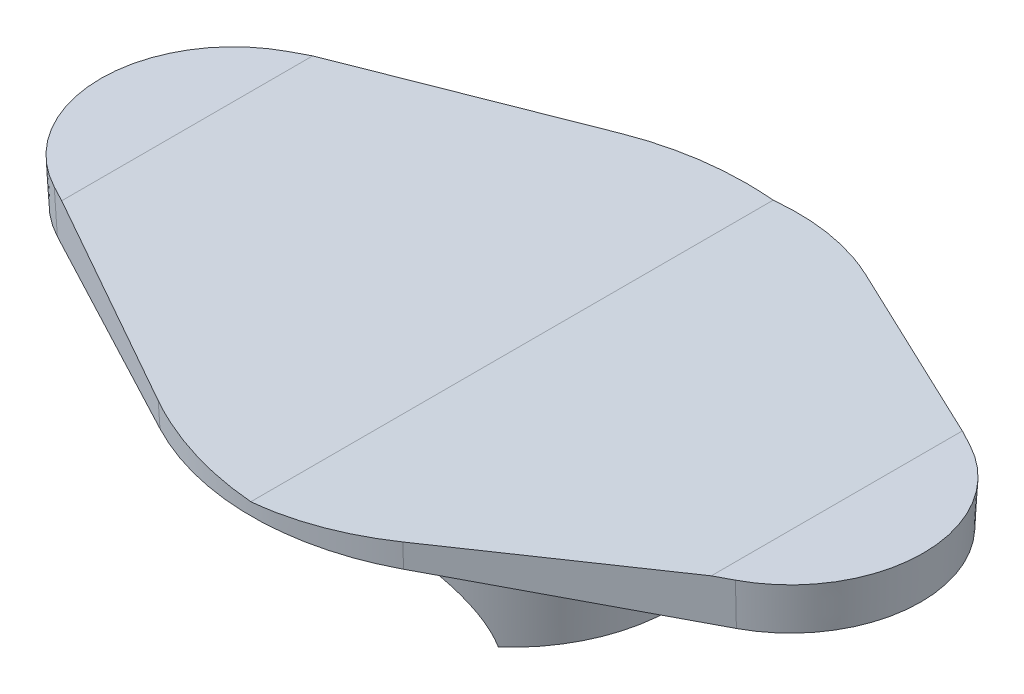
ISO-10303-21;
HEADER;
FILE_DESCRIPTION(('STEP AP214'),'2;1');
FILE_NAME('part.step','',(''),(''),'','','');
FILE_SCHEMA(('AUTOMOTIVE_DESIGN { 1 0 10303 214 1 1 1 1 }'));
ENDSEC;
DATA;
#1=APPLICATION_CONTEXT('core data for automotive mechanical design processes');
#2=APPLICATION_PROTOCOL_DEFINITION('international standard','automotive_design',2000,#1);
#3=PRODUCT_CONTEXT('',#1,'mechanical');
#4=PRODUCT('Part','Part','',(#3));
#5=PRODUCT_RELATED_PRODUCT_CATEGORY('part','',(#4));
#6=PRODUCT_DEFINITION_FORMATION('','',#4);
#7=PRODUCT_DEFINITION_CONTEXT('part definition',#1,'design');
#8=PRODUCT_DEFINITION('design','',#6,#7);
#9=PRODUCT_DEFINITION_SHAPE('','',#8);
#10=(LENGTH_UNIT() NAMED_UNIT(*) SI_UNIT(.MILLI.,.METRE.));
#11=(NAMED_UNIT(*) PLANE_ANGLE_UNIT() SI_UNIT($,.RADIAN.));
#12=(NAMED_UNIT(*) SI_UNIT($,.STERADIAN.) SOLID_ANGLE_UNIT());
#13=UNCERTAINTY_MEASURE_WITH_UNIT(LENGTH_MEASURE(1.E-05),#10,'distance_accuracy_value','');
#14=(GEOMETRIC_REPRESENTATION_CONTEXT(3) GLOBAL_UNCERTAINTY_ASSIGNED_CONTEXT((#13)) GLOBAL_UNIT_ASSIGNED_CONTEXT((#10,
#11,#12)) REPRESENTATION_CONTEXT('',''));
#15=CARTESIAN_POINT('',(0.,0.,0.));
#16=DIRECTION('',(0.,0.,1.));
#17=DIRECTION('',(1.,0.,0.));
#18=AXIS2_PLACEMENT_3D('',#15,#16,#17);
#19=CARTESIAN_POINT('',(0.,-3.81,0.));
#20=DIRECTION('',(0.,-1.,0.));
#21=DIRECTION('',(0.,0.,-1.));
#22=AXIS2_PLACEMENT_3D('',#19,#20,#21);
#23=PLANE('',#22);
#24=DIRECTION('',(0.,0.,1.));
#25=VECTOR('',#24,1.);
#26=CARTESIAN_POINT('',(3.11085197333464,-3.81,-7.69986945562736));
#27=LINE('',#26,#25);
#28=CARTESIAN_POINT('',(3.11085197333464,-3.81,-3.50956853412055));
#29=VERTEX_POINT('',#28);
#30=CARTESIAN_POINT('',(3.11085197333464,-3.81,-3.00782840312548));
#31=VERTEX_POINT('',#30);
#32=EDGE_CURVE('E186',#29,#31,#27,.T.);
#33=ORIENTED_EDGE('',*,*,#32,.F.);
#34=CARTESIAN_POINT('',(0.,-3.81,0.));
#35=DIRECTION('',(0.,-1.,0.));
#36=DIRECTION('',(0.,0.,-1.));
#37=AXIS2_PLACEMENT_3D('',#34,#35,#36);
#38=CIRCLE('',#37,4.68982636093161);
#39=CARTESIAN_POINT('',(3.11085197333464,-3.81,3.50956853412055));
#40=VERTEX_POINT('',#39);
#41=EDGE_CURVE('E297',#29,#40,#38,.T.);
#42=ORIENTED_EDGE('',*,*,#41,.T.);
#43=CARTESIAN_POINT('',(3.11085197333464,-3.81,3.00782840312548));
#44=VERTEX_POINT('',#43);
#45=EDGE_CURVE('E189',#44,#40,#27,.T.);
#46=ORIENTED_EDGE('',*,*,#45,.F.);
#47=CARTESIAN_POINT('',(0.,-3.81,0.));
#48=DIRECTION('',(0.,-1.,0.));
#49=DIRECTION('',(0.,0.,-1.));
#50=AXIS2_PLACEMENT_3D('',#47,#48,#49);
#51=CIRCLE('',#50,4.32717363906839);
#52=EDGE_CURVE('E298',#31,#44,#51,.T.);
#53=ORIENTED_EDGE('',*,*,#52,.F.);
#54=EDGE_LOOP('',(#33,#42,#46,#53));
#55=FACE_BOUND('',#54,.T.);
#56=ADVANCED_FACE('F35',(#55),#23,.T.);
#57=CARTESIAN_POINT('',(0.,0.,0.));
#58=DIRECTION('',(0.,1.,0.));
#59=DIRECTION('',(0.,0.,1.));
#60=AXIS2_PLACEMENT_3D('',#57,#58,#59);
#61=PLANE('',#60);
#62=CARTESIAN_POINT('',(0.,0.,0.));
#63=DIRECTION('',(0.,1.,0.));
#64=DIRECTION('',(0.,0.,1.));
#65=AXIS2_PLACEMENT_3D('',#62,#63,#64);
#66=CIRCLE('',#65,7.62);
#67=CARTESIAN_POINT('',(3.56159900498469,0.,-6.73642431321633));
#68=VERTEX_POINT('',#67);
#69=CARTESIAN_POINT('',(-3.56159900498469,0.,-6.73642431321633));
#70=VERTEX_POINT('',#69);
#71=EDGE_CURVE('E299',#68,#70,#66,.T.);
#72=ORIENTED_EDGE('',*,*,#71,.F.);
#73=DIRECTION('',(-0.88404518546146,0.,-0.467401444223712));
#74=VECTOR('',#73,1.);
#75=CARTESIAN_POINT('',(3.56159900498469,0.,-6.73642431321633));
#76=LINE('',#75,#74);
#77=CARTESIAN_POINT('',(9.93225056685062,0.,-3.36821215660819));
#78=VERTEX_POINT('',#77);
#79=EDGE_CURVE('E322',#78,#68,#76,.T.);
#80=ORIENTED_EDGE('',*,*,#79,.F.);
#81=CARTESIAN_POINT('',(8.15145106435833,0.,0.));
#82=DIRECTION('',(0.,1.,0.));
#83=DIRECTION('',(0.,0.,1.));
#84=AXIS2_PLACEMENT_3D('',#81,#82,#83);
#85=CIRCLE('',#84,3.81);
#86=CARTESIAN_POINT('',(9.93225056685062,0.,3.36821215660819));
#87=VERTEX_POINT('',#86);
#88=EDGE_CURVE('E319',#87,#78,#85,.T.);
#89=ORIENTED_EDGE('',*,*,#88,.F.);
#90=DIRECTION('',(0.88404518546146,0.,-0.467401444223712));
#91=VECTOR('',#90,1.);
#92=CARTESIAN_POINT('',(9.93225056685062,0.,3.36821215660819));
#93=LINE('',#92,#91);
#94=CARTESIAN_POINT('',(3.56159900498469,0.,6.73642431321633));
#95=VERTEX_POINT('',#94);
#96=EDGE_CURVE('E317',#95,#87,#93,.T.);
#97=ORIENTED_EDGE('',*,*,#96,.F.);
#98=CARTESIAN_POINT('',(0.,0.,0.));
#99=DIRECTION('',(0.,1.,0.));
#100=DIRECTION('',(0.,0.,1.));
#101=AXIS2_PLACEMENT_3D('',#98,#99,#100);
#102=CIRCLE('',#101,7.61999999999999);
#103=CARTESIAN_POINT('',(-3.56159900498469,0.,6.73642431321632));
#104=VERTEX_POINT('',#103);
#105=EDGE_CURVE('E314',#104,#95,#102,.T.);
#106=ORIENTED_EDGE('',*,*,#105,.F.);
#107=DIRECTION('',(0.88404518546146,0.,0.467401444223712));
#108=VECTOR('',#107,1.);
#109=CARTESIAN_POINT('',(-9.93225056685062,0.,3.36821215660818));
#110=LINE('',#109,#108);
#111=CARTESIAN_POINT('',(-9.93225056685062,0.,3.36821215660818));
#112=VERTEX_POINT('',#111);
#113=EDGE_CURVE('E311',#112,#104,#110,.T.);
#114=ORIENTED_EDGE('',*,*,#113,.F.);
#115=CARTESIAN_POINT('',(-8.15145106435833,0.,0.));
#116=DIRECTION('',(0.,1.,0.));
#117=DIRECTION('',(0.,0.,-1.));
#118=AXIS2_PLACEMENT_3D('',#115,#116,#117);
#119=CIRCLE('',#118,3.81);
#120=CARTESIAN_POINT('',(-9.93225056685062,0.,-3.36821215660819));
#121=VERTEX_POINT('',#120);
#122=EDGE_CURVE('E308',#121,#112,#119,.T.);
#123=ORIENTED_EDGE('',*,*,#122,.F.);
#124=DIRECTION('',(-0.88404518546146,0.,0.467401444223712));
#125=VECTOR('',#124,1.);
#126=CARTESIAN_POINT('',(-3.56159900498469,0.,-6.73642431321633));
#127=LINE('',#126,#125);
#128=EDGE_CURVE('E305',#70,#121,#127,.T.);
#129=ORIENTED_EDGE('',*,*,#128,.F.);
#130=EDGE_LOOP('',(#72,#80,#89,#97,#106,#114,#123,#129));
#131=FACE_BOUND('',#130,.T.);
#132=CARTESIAN_POINT('',(0.,0.,0.));
#133=DIRECTION('',(0.,1.,0.));
#134=DIRECTION('',(0.,0.,1.));
#135=AXIS2_PLACEMENT_3D('',#132,#133,#134);
#136=CIRCLE('',#135,4.8895);
#137=CARTESIAN_POINT('',(0.,0.,4.8895));
#138=VERTEX_POINT('',#137);
#139=EDGE_CURVE('E328',#138,#138,#136,.F.);
#140=ORIENTED_EDGE('',*,*,#139,.F.);
#141=EDGE_LOOP('',(#140));
#142=FACE_BOUND('',#141,.T.);
#143=ADVANCED_FACE('F242',(#131,#142),#61,.F.);
#144=CARTESIAN_POINT('',(0.,0.,0.));
#145=DIRECTION('',(0.,1.,0.));
#146=DIRECTION('',(0.,0.,1.));
#147=AXIS2_PLACEMENT_3D('',#144,#145,#146);
#148=CONICAL_SURFACE('',#147,7.62,0.05235987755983);
#149=DIRECTION('',(-0.024461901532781,0.998629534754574,-0.0462673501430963));
#150=VECTOR('',#149,1.);
#151=CARTESIAN_POINT('',(-3.56159900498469,0.,-6.73642431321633));
#152=LINE('',#151,#150);
#153=CARTESIAN_POINT('',(-3.57913494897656,0.71588513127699,-6.76959187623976));
#154=VERTEX_POINT('',#153);
#155=EDGE_CURVE('E326',#154,#70,#152,.F.);
#156=ORIENTED_EDGE('',*,*,#155,.F.);
#157=CARTESIAN_POINT('',(-0.0374641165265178,0.384505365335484,0.));
#158=DIRECTION('',(-0.0931590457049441,-0.995651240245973,0.));
#159=DIRECTION('',(-0.995651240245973,0.0931590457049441,0.));
#160=AXIS2_PLACEMENT_3D('',#157,#158,#159);
#161=ELLIPSE('',#160,7.67352137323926,7.64005921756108);
#162=CARTESIAN_POINT('',(0.,0.381,-7.63996736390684));
#163=VERTEX_POINT('',#162);
#164=EDGE_CURVE('E175',#154,#163,#161,.T.);
#165=ORIENTED_EDGE('',*,*,#164,.T.);
#166=CARTESIAN_POINT('',(0.0374641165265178,0.384505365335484,0.));
#167=DIRECTION('',(0.0931590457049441,-0.995651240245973,0.));
#168=DIRECTION('',(0.995651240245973,0.0931590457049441,0.));
#169=AXIS2_PLACEMENT_3D('',#166,#167,#168);
#170=ELLIPSE('',#169,7.67352137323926,7.64005921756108);
#171=CARTESIAN_POINT('',(3.57913494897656,0.715885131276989,-6.76959187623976));
#172=VERTEX_POINT('',#171);
#173=EDGE_CURVE('E148',#163,#172,#170,.T.);
#174=ORIENTED_EDGE('',*,*,#173,.T.);
#175=DIRECTION('',(0.024461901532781,0.998629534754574,-0.0462673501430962));
#176=VECTOR('',#175,1.);
#177=CARTESIAN_POINT('',(3.56159900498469,0.,-6.73642431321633));
#178=LINE('',#177,#176);
#179=EDGE_CURVE('E325',#172,#68,#178,.F.);
#180=ORIENTED_EDGE('',*,*,#179,.T.);
#181=ORIENTED_EDGE('',*,*,#71,.T.);
#182=EDGE_LOOP('',(#156,#165,#174,#180,#181));
#183=FACE_BOUND('',#182,.T.);
#184=ADVANCED_FACE('F243',(#183),#148,.T.);
#185=CARTESIAN_POINT('',(-3.56159900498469,0.,-6.73642431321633));
#186=DIRECTION('',(-0.466760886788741,-0.0523359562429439,-0.882833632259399));
#187=DIRECTION('',(-0.88404518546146,0.,0.467401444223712));
#188=AXIS2_PLACEMENT_3D('',#185,#186,#187);
#189=PLANE('',#188);
#190=DIRECTION('',(-0.88404518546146,0.,0.467401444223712));
#191=VECTOR('',#190,1.);
#192=CARTESIAN_POINT('',(-3.59270825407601,1.27,-6.79526448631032));
#193=LINE('',#192,#191);
#194=CARTESIAN_POINT('',(-9.96335981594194,1.27,-3.42705232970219));
#195=VERTEX_POINT('',#194);
#196=CARTESIAN_POINT('',(-9.50132051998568,1.27,-3.67133603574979));
#197=VERTEX_POINT('',#196);
#198=EDGE_CURVE('E181',#195,#197,#193,.F.);
#199=ORIENTED_EDGE('',*,*,#198,.T.);
#200=DIRECTION('',(-0.883038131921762,0.0826222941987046,0.461971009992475));
#201=VECTOR('',#200,1.);
#202=CARTESIAN_POINT('',(-3.5267614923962,0.71098475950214,-6.79699162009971));
#203=LINE('',#202,#201);
#204=EDGE_CURVE('E168',#197,#154,#203,.F.);
#205=ORIENTED_EDGE('',*,*,#204,.T.);
#206=ORIENTED_EDGE('',*,*,#155,.T.);
#207=ORIENTED_EDGE('',*,*,#128,.T.);
#208=DIRECTION('',(-0.0244619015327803,0.998629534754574,-0.0462673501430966));
#209=VECTOR('',#208,1.);
#210=CARTESIAN_POINT('',(-9.93225056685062,0.,-3.36821215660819));
#211=LINE('',#210,#209);
#212=EDGE_CURVE('E329',#195,#121,#211,.F.);
#213=ORIENTED_EDGE('',*,*,#212,.F.);
#214=EDGE_LOOP('',(#199,#205,#206,#207,#213));
#215=FACE_BOUND('',#214,.T.);
#216=ADVANCED_FACE('F246',(#215),#189,.T.);
#217=CARTESIAN_POINT('',(-8.15145106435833,0.,0.));
#218=DIRECTION('',(0.,1.,0.));
#219=DIRECTION('',(0.,0.,-1.));
#220=AXIS2_PLACEMENT_3D('',#217,#218,#219);
#221=CONICAL_SURFACE('',#220,3.81,0.05235987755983);
#222=DIRECTION('',(-0.024461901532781,0.998629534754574,0.0462673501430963));
#223=VECTOR('',#222,1.);
#224=CARTESIAN_POINT('',(-9.93225056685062,0.,3.36821215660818));
#225=LINE('',#224,#223);
#226=CARTESIAN_POINT('',(-9.96335981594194,1.27,3.42705232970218));
#227=VERTEX_POINT('',#226);
#228=EDGE_CURVE('E338',#227,#112,#225,.F.);
#229=ORIENTED_EDGE('',*,*,#228,.F.);
#230=CARTESIAN_POINT('',(-8.15145106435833,1.27,0.));
#231=DIRECTION('',(0.,-1.,0.));
#232=DIRECTION('',(0.,0.,-1.));
#233=AXIS2_PLACEMENT_3D('',#230,#231,#232);
#234=CIRCLE('',#233,3.87655787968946);
#235=EDGE_CURVE('E178',#227,#195,#234,.T.);
#236=ORIENTED_EDGE('',*,*,#235,.T.);
#237=ORIENTED_EDGE('',*,*,#212,.T.);
#238=ORIENTED_EDGE('',*,*,#122,.T.);
#239=EDGE_LOOP('',(#229,#236,#237,#238));
#240=FACE_BOUND('',#239,.T.);
#241=ADVANCED_FACE('F265',(#240),#221,.T.);
#242=CARTESIAN_POINT('',(-9.93225056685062,0.,3.36821215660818));
#243=DIRECTION('',(-0.466760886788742,-0.0523359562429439,0.882833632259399));
#244=DIRECTION('',(0.88404518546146,0.,0.467401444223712));
#245=AXIS2_PLACEMENT_3D('',#242,#243,#244);
#246=PLANE('',#245);
#247=DIRECTION('',(-0.0244619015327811,0.998629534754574,0.0462673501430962));
#248=VECTOR('',#247,1.);
#249=CARTESIAN_POINT('',(-3.56159900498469,0.,6.73642431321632));
#250=LINE('',#249,#248);
#251=CARTESIAN_POINT('',(-3.57913494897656,0.71588513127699,6.76959187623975));
#252=VERTEX_POINT('',#251);
#253=EDGE_CURVE('E336',#252,#104,#250,.F.);
#254=ORIENTED_EDGE('',*,*,#253,.F.);
#255=DIRECTION('',(0.883038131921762,-0.0826222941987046,0.461971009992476));
#256=VECTOR('',#255,1.);
#257=CARTESIAN_POINT('',(-9.86833924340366,1.30434045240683,3.4793261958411));
#258=LINE('',#257,#256);
#259=CARTESIAN_POINT('',(-9.50132051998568,1.27,3.67133603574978));
#260=VERTEX_POINT('',#259);
#261=EDGE_CURVE('E164',#252,#260,#258,.F.);
#262=ORIENTED_EDGE('',*,*,#261,.T.);
#263=DIRECTION('',(0.88404518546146,0.,0.467401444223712));
#264=VECTOR('',#263,1.);
#265=CARTESIAN_POINT('',(-9.96335981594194,1.27,3.42705232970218));
#266=LINE('',#265,#264);
#267=EDGE_CURVE('E482',#260,#227,#266,.F.);
#268=ORIENTED_EDGE('',*,*,#267,.T.);
#269=ORIENTED_EDGE('',*,*,#228,.T.);
#270=ORIENTED_EDGE('',*,*,#113,.T.);
#271=EDGE_LOOP('',(#254,#262,#268,#269,#270));
#272=FACE_BOUND('',#271,.T.);
#273=ADVANCED_FACE('F261',(#272),#246,.T.);
#274=CARTESIAN_POINT('',(0.,0.,0.));
#275=DIRECTION('',(0.,1.,0.));
#276=DIRECTION('',(0.,0.,1.));
#277=AXIS2_PLACEMENT_3D('',#274,#275,#276);
#278=CONICAL_SURFACE('',#277,7.61999999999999,0.05235987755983);
#279=CARTESIAN_POINT('',(0.0374641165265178,0.384505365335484,0.));
#280=DIRECTION('',(0.0931590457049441,-0.995651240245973,0.));
#281=DIRECTION('',(0.995651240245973,0.0931590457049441,0.));
#282=AXIS2_PLACEMENT_3D('',#279,#280,#281);
#283=ELLIPSE('',#282,7.67352137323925,7.64005921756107);
#284=CARTESIAN_POINT('',(3.57913494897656,0.715885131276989,6.76959187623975));
#285=VERTEX_POINT('',#284);
#286=CARTESIAN_POINT('',(0.,0.381,7.63996736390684));
#287=VERTEX_POINT('',#286);
#288=EDGE_CURVE('E144',#285,#287,#283,.T.);
#289=ORIENTED_EDGE('',*,*,#288,.T.);
#290=CARTESIAN_POINT('',(-0.0374641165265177,0.384505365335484,0.));
#291=DIRECTION('',(-0.0931590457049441,-0.995651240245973,0.));
#292=DIRECTION('',(-0.995651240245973,0.0931590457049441,0.));
#293=AXIS2_PLACEMENT_3D('',#290,#291,#292);
#294=ELLIPSE('',#293,7.67352137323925,7.64005921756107);
#295=EDGE_CURVE('E484',#287,#252,#294,.T.);
#296=ORIENTED_EDGE('',*,*,#295,.T.);
#297=ORIENTED_EDGE('',*,*,#253,.T.);
#298=ORIENTED_EDGE('',*,*,#105,.T.);
#299=DIRECTION('',(0.024461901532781,0.998629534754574,0.0462673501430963));
#300=VECTOR('',#299,1.);
#301=CARTESIAN_POINT('',(3.56159900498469,0.,6.73642431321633));
#302=LINE('',#301,#300);
#303=EDGE_CURVE('E334',#285,#95,#302,.F.);
#304=ORIENTED_EDGE('',*,*,#303,.F.);
#305=EDGE_LOOP('',(#289,#296,#297,#298,#304));
#306=FACE_BOUND('',#305,.T.);
#307=ADVANCED_FACE('F258',(#306),#278,.T.);
#308=CARTESIAN_POINT('',(9.93225056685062,0.,3.36821215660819));
#309=DIRECTION('',(0.466760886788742,-0.0523359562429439,0.882833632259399));
#310=DIRECTION('',(0.88404518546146,0.,-0.467401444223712));
#311=AXIS2_PLACEMENT_3D('',#308,#309,#310);
#312=PLANE('',#311);
#313=DIRECTION('',(0.0244619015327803,0.998629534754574,0.0462673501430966));
#314=VECTOR('',#313,1.);
#315=CARTESIAN_POINT('',(9.93225056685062,0.,3.36821215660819));
#316=LINE('',#315,#314);
#317=CARTESIAN_POINT('',(9.96335981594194,1.27,3.42705232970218));
#318=VERTEX_POINT('',#317);
#319=EDGE_CURVE('E163',#318,#87,#316,.F.);
#320=ORIENTED_EDGE('',*,*,#319,.F.);
#321=DIRECTION('',(0.88404518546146,0.,-0.467401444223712));
#322=VECTOR('',#321,1.);
#323=CARTESIAN_POINT('',(9.96335981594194,1.27,3.42705232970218));
#324=LINE('',#323,#322);
#325=CARTESIAN_POINT('',(9.50132051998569,1.27,3.67133603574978));
#326=VERTEX_POINT('',#325);
#327=EDGE_CURVE('E152',#318,#326,#324,.F.);
#328=ORIENTED_EDGE('',*,*,#327,.T.);
#329=DIRECTION('',(0.883038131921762,0.0826222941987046,-0.461971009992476));
#330=VECTOR('',#329,1.);
#331=CARTESIAN_POINT('',(9.86833924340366,1.30434045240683,3.47932619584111));
#332=LINE('',#331,#330);
#333=EDGE_CURVE('E140',#326,#285,#332,.F.);
#334=ORIENTED_EDGE('',*,*,#333,.T.);
#335=ORIENTED_EDGE('',*,*,#303,.T.);
#336=ORIENTED_EDGE('',*,*,#96,.T.);
#337=EDGE_LOOP('',(#320,#328,#334,#335,#336));
#338=FACE_BOUND('',#337,.T.);
#339=ADVANCED_FACE('F161',(#338),#312,.T.);
#340=CARTESIAN_POINT('',(8.15145106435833,0.,0.));
#341=DIRECTION('',(0.,1.,0.));
#342=DIRECTION('',(0.,0.,1.));
#343=AXIS2_PLACEMENT_3D('',#340,#341,#342);
#344=CONICAL_SURFACE('',#343,3.81,0.05235987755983);
#345=DIRECTION('',(0.024461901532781,0.998629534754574,-0.0462673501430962));
#346=VECTOR('',#345,1.);
#347=CARTESIAN_POINT('',(9.93225056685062,0.,-3.36821215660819));
#348=LINE('',#347,#346);
#349=CARTESIAN_POINT('',(9.96335981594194,1.27,-3.42705232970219));
#350=VERTEX_POINT('',#349);
#351=EDGE_CURVE('E331',#350,#78,#348,.F.);
#352=ORIENTED_EDGE('',*,*,#351,.F.);
#353=CARTESIAN_POINT('',(8.15145106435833,1.27,0.));
#354=DIRECTION('',(0.,-1.,0.));
#355=DIRECTION('',(0.,0.,-1.));
#356=AXIS2_PLACEMENT_3D('',#353,#354,#355);
#357=CIRCLE('',#356,3.87655787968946);
#358=EDGE_CURVE('E165',#350,#318,#357,.T.);
#359=ORIENTED_EDGE('',*,*,#358,.T.);
#360=ORIENTED_EDGE('',*,*,#319,.T.);
#361=ORIENTED_EDGE('',*,*,#88,.T.);
#362=EDGE_LOOP('',(#352,#359,#360,#361));
#363=FACE_BOUND('',#362,.T.);
#364=ADVANCED_FACE('F251',(#363),#344,.T.);
#365=CARTESIAN_POINT('',(3.56159900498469,0.,-6.73642431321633));
#366=DIRECTION('',(0.466760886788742,-0.0523359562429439,-0.882833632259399));
#367=DIRECTION('',(-0.88404518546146,0.,-0.467401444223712));
#368=AXIS2_PLACEMENT_3D('',#365,#366,#367);
#369=PLANE('',#368);
#370=DIRECTION('',(-0.883038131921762,-0.0826222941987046,-0.461971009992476));
#371=VECTOR('',#370,1.);
#372=CARTESIAN_POINT('',(3.5267614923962,0.71098475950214,-6.79699162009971));
#373=LINE('',#372,#371);
#374=CARTESIAN_POINT('',(9.50132051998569,1.27,-3.67133603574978));
#375=VERTEX_POINT('',#374);
#376=EDGE_CURVE('E230',#172,#375,#373,.F.);
#377=ORIENTED_EDGE('',*,*,#376,.T.);
#378=DIRECTION('',(-0.88404518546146,0.,-0.467401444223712));
#379=VECTOR('',#378,1.);
#380=CARTESIAN_POINT('',(3.59270825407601,1.27,-6.79526448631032));
#381=LINE('',#380,#379);
#382=EDGE_CURVE('E155',#375,#350,#381,.F.);
#383=ORIENTED_EDGE('',*,*,#382,.T.);
#384=ORIENTED_EDGE('',*,*,#351,.T.);
#385=ORIENTED_EDGE('',*,*,#79,.T.);
#386=ORIENTED_EDGE('',*,*,#179,.F.);
#387=EDGE_LOOP('',(#377,#383,#384,#385,#386));
#388=FACE_BOUND('',#387,.T.);
#389=ADVANCED_FACE('F248',(#388),#369,.T.);
#390=DIRECTION('',(0.,0.,1.));
#391=VECTOR('',#390,1.);
#392=CARTESIAN_POINT('',(-3.11085197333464,-3.81,-7.69986945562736));
#393=LINE('',#392,#391);
#394=CARTESIAN_POINT('',(-3.11085197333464,-3.81,3.50956853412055));
#395=VERTEX_POINT('',#394);
#396=CARTESIAN_POINT('',(-3.11085197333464,-3.81,3.00782840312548));
#397=VERTEX_POINT('',#396);
#398=EDGE_CURVE('E58',#395,#397,#393,.F.);
#399=ORIENTED_EDGE('',*,*,#398,.F.);
#400=CARTESIAN_POINT('',(-3.11085197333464,-3.81,-3.50956853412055));
#401=VERTEX_POINT('',#400);
#402=EDGE_CURVE('E290',#395,#401,#38,.T.);
#403=ORIENTED_EDGE('',*,*,#402,.T.);
#404=CARTESIAN_POINT('',(-3.11085197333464,-3.81,-3.00782840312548));
#405=VERTEX_POINT('',#404);
#406=EDGE_CURVE('E184',#405,#401,#393,.F.);
#407=ORIENTED_EDGE('',*,*,#406,.F.);
#408=EDGE_CURVE('E292',#397,#405,#51,.T.);
#409=ORIENTED_EDGE('',*,*,#408,.F.);
#410=EDGE_LOOP('',(#399,#403,#407,#409));
#411=FACE_BOUND('',#410,.T.);
#412=ADVANCED_FACE('F214',(#411),#23,.T.);
#413=CARTESIAN_POINT('',(0.,0.,0.));
#414=DIRECTION('',(0.,1.,0.));
#415=DIRECTION('',(0.,0.,-1.));
#416=AXIS2_PLACEMENT_3D('',#413,#414,#415);
#417=CONICAL_SURFACE('',#416,4.8895,0.05235987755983);
#418=ORIENTED_EDGE('',*,*,#402,.F.);
#419=CARTESIAN_POINT('',(-3.11089279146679,-3.81020000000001,3.5095183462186));
#420=CARTESIAN_POINT('',(-3.09244623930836,-3.71981178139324,3.53219478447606));
#421=CARTESIAN_POINT('',(-3.07022673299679,-3.63101749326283,3.55776072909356));
#422=CARTESIAN_POINT('',(-3.01876055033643,-3.45711295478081,3.61341733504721));
#423=CARTESIAN_POINT('',(-2.98952552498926,-3.37199686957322,3.64350046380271));
#424=CARTESIAN_POINT('',(-2.92463203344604,-3.20602550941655,3.70687441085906));
#425=CARTESIAN_POINT('',(-2.88900361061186,-3.12515249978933,3.74014990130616));
#426=CARTESIAN_POINT('',(-2.811591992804,-2.96740049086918,3.80896841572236));
#427=CARTESIAN_POINT('',(-2.76980596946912,-2.89052334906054,3.84451247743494));
#428=CARTESIAN_POINT('',(-2.63621087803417,-2.66707826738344,3.95262261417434));
#429=CARTESIAN_POINT('',(-2.53570045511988,-2.52652767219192,4.02713949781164));
#430=CARTESIAN_POINT('',(-2.31274635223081,-2.26285481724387,4.17501454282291));
#431=CARTESIAN_POINT('',(-2.19024911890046,-2.13977645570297,4.2483693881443));
#432=CARTESIAN_POINT('',(-1.9084978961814,-1.90015469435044,4.39647481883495));
#433=CARTESIAN_POINT('',(-1.74661307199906,-1.78609249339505,4.47037034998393));
#434=CARTESIAN_POINT('',(-1.48659605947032,-1.63775628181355,4.56879427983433));
#435=CARTESIAN_POINT('',(-1.3971162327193,-1.59212381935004,4.59951798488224));
#436=CARTESIAN_POINT('',(-1.21293982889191,-1.50908465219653,4.65597506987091));
#437=CARTESIAN_POINT('',(-1.11824568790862,-1.47167414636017,4.68171075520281));
#438=CARTESIAN_POINT('',(-0.882410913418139,-1.39156822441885,4.73719326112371));
#439=CARTESIAN_POINT('',(-0.738886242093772,-1.35357803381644,4.76386554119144));
#440=CARTESIAN_POINT('',(-0.44613625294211,-1.29797490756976,4.80305947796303));
#441=CARTESIAN_POINT('',(-0.296914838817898,-1.28034826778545,4.81559065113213));
#442=CARTESIAN_POINT('',(0.00332292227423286,-1.26644246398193,4.82546847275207));
#443=CARTESIAN_POINT('',(0.154342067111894,-1.27020264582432,4.82278713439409));
#444=CARTESIAN_POINT('',(0.453316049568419,-1.29893889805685,4.80240759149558));
#445=CARTESIAN_POINT('',(0.601270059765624,-1.32392062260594,4.7847053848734));
#446=CARTESIAN_POINT('',(0.886852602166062,-1.39291158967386,4.73631790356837));
#447=CARTESIAN_POINT('',(1.02463617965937,-1.4364927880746,4.70592501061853));
#448=CARTESIAN_POINT('',(1.29058115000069,-1.54061716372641,4.6343876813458));
#449=CARTESIAN_POINT('',(1.41874144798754,-1.60116226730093,4.59324202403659));
#450=CARTESIAN_POINT('',(1.67742492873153,-1.74478664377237,4.49763192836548));
#451=CARTESIAN_POINT('',(1.80660096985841,-1.82963167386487,4.44219127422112));
#452=CARTESIAN_POINT('',(2.04962821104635,-2.01537113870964,4.32466953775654));
#453=CARTESIAN_POINT('',(2.16345723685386,-2.11628834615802,4.26257907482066));
#454=CARTESIAN_POINT('',(2.39417056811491,-2.3520267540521,4.1238516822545));
#455=CARTESIAN_POINT('',(2.50782023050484,-2.48967418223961,4.04662823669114));
#456=CARTESIAN_POINT('',(2.71092910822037,-2.782708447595,3.89476328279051));
#457=CARTESIAN_POINT('',(2.8004332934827,-2.93806152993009,3.82011720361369));
#458=CARTESIAN_POINT('',(2.92856267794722,-3.21249714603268,3.70372220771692));
#459=CARTESIAN_POINT('',(2.97428150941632,-3.32706517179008,3.65914053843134));
#460=CARTESIAN_POINT('',(3.05269338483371,-3.56341649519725,3.57771889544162));
#461=CARTESIAN_POINT('',(3.08536159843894,-3.68521304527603,3.54089374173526));
#462=CARTESIAN_POINT('',(3.11089279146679,-3.81020000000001,3.5095183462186));
#463=B_SPLINE_CURVE_WITH_KNOTS('',3,(#419,#420,#421,#422,#423,#424,#425,#426,#427,#428,#429,
#430,#431,#432,#433,#434,#435,#436,#437,#438,#439,#440,#441,#442,#443,#444,#445,#446,#447,#448,
#449,#450,#451,#452,#453,#454,#455,#456,#457,#458,#459,#460,#461,#462),.UNSPECIFIED.,.F.,.F.,(4,
2,2,2,2,2,2,2,2,2,2,2,2,2,2,2,2,2,2,2,2,4),(0.,0.284724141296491,0.56897866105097,
0.851930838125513,1.13501339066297,1.6971905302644,2.2607560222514,2.8907640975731,
3.20539951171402,3.51988915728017,3.9703151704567,4.42043788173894,4.87138896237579,
5.32246022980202,5.76366738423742,6.20492465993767,6.69567207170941,7.18712111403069,
7.76827254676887,8.34833401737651,8.74083610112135,9.13408144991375),.UNSPECIFIED.);
#464=EDGE_CURVE('E197',#395,#40,#463,.T.);
#465=ORIENTED_EDGE('',*,*,#464,.T.);
#466=ORIENTED_EDGE('',*,*,#41,.F.);
#467=CARTESIAN_POINT('',(3.11089279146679,-3.81020000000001,-3.5095183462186));
#468=CARTESIAN_POINT('',(3.09244623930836,-3.71981178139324,-3.53219478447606));
#469=CARTESIAN_POINT('',(3.07022673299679,-3.63101749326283,-3.55776072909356));
#470=CARTESIAN_POINT('',(3.01876055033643,-3.45711295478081,-3.61341733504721));
#471=CARTESIAN_POINT('',(2.98952552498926,-3.37199686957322,-3.64350046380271));
#472=CARTESIAN_POINT('',(2.92463203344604,-3.20602550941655,-3.70687441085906));
#473=CARTESIAN_POINT('',(2.88900361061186,-3.12515249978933,-3.74014990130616));
#474=CARTESIAN_POINT('',(2.811591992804,-2.96740049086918,-3.80896841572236));
#475=CARTESIAN_POINT('',(2.76980596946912,-2.89052334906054,-3.84451247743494));
#476=CARTESIAN_POINT('',(2.63621087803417,-2.66707826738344,-3.95262261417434));
#477=CARTESIAN_POINT('',(2.53570045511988,-2.52652767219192,-4.02713949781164));
#478=CARTESIAN_POINT('',(2.31274635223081,-2.26285481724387,-4.17501454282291));
#479=CARTESIAN_POINT('',(2.19024911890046,-2.13977645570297,-4.2483693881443));
#480=CARTESIAN_POINT('',(1.9084978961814,-1.90015469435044,-4.39647481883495));
#481=CARTESIAN_POINT('',(1.74661307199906,-1.78609249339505,-4.47037034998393));
#482=CARTESIAN_POINT('',(1.48659605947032,-1.63775628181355,-4.56879427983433));
#483=CARTESIAN_POINT('',(1.3971162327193,-1.59212381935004,-4.59951798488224));
#484=CARTESIAN_POINT('',(1.21293982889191,-1.50908465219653,-4.65597506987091));
#485=CARTESIAN_POINT('',(1.11824568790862,-1.47167414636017,-4.68171075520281));
#486=CARTESIAN_POINT('',(0.882410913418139,-1.39156822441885,-4.73719326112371));
#487=CARTESIAN_POINT('',(0.738886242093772,-1.35357803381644,-4.76386554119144));
#488=CARTESIAN_POINT('',(0.44613625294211,-1.29797490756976,-4.80305947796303));
#489=CARTESIAN_POINT('',(0.296914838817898,-1.28034826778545,-4.81559065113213));
#490=CARTESIAN_POINT('',(-0.00332292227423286,-1.26644246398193,-4.82546847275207));
#491=CARTESIAN_POINT('',(-0.154342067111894,-1.27020264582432,-4.82278713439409));
#492=CARTESIAN_POINT('',(-0.453316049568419,-1.29893889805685,-4.80240759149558));
#493=CARTESIAN_POINT('',(-0.601270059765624,-1.32392062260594,-4.7847053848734));
#494=CARTESIAN_POINT('',(-0.886852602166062,-1.39291158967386,-4.73631790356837));
#495=CARTESIAN_POINT('',(-1.02463617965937,-1.4364927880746,-4.70592501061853));
#496=CARTESIAN_POINT('',(-1.29058115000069,-1.54061716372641,-4.6343876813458));
#497=CARTESIAN_POINT('',(-1.41874144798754,-1.60116226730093,-4.59324202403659));
#498=CARTESIAN_POINT('',(-1.67742492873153,-1.74478664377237,-4.49763192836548));
#499=CARTESIAN_POINT('',(-1.80660096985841,-1.82963167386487,-4.44219127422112));
#500=CARTESIAN_POINT('',(-2.04962821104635,-2.01537113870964,-4.32466953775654));
#501=CARTESIAN_POINT('',(-2.16345723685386,-2.11628834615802,-4.26257907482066));
#502=CARTESIAN_POINT('',(-2.39417056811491,-2.3520267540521,-4.1238516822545));
#503=CARTESIAN_POINT('',(-2.50782023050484,-2.48967418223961,-4.04662823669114));
#504=CARTESIAN_POINT('',(-2.71092910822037,-2.782708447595,-3.89476328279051));
#505=CARTESIAN_POINT('',(-2.8004332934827,-2.93806152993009,-3.82011720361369));
#506=CARTESIAN_POINT('',(-2.92856267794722,-3.21249714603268,-3.70372220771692));
#507=CARTESIAN_POINT('',(-2.97428150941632,-3.32706517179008,-3.65914053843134));
#508=CARTESIAN_POINT('',(-3.05269338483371,-3.56341649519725,-3.57771889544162));
#509=CARTESIAN_POINT('',(-3.08536159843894,-3.68521304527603,-3.54089374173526));
#510=CARTESIAN_POINT('',(-3.11089279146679,-3.81020000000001,-3.5095183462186));
#511=B_SPLINE_CURVE_WITH_KNOTS('',3,(#467,#468,#469,#470,#471,#472,#473,#474,#475,#476,#477,
#478,#479,#480,#481,#482,#483,#484,#485,#486,#487,#488,#489,#490,#491,#492,#493,#494,#495,#496,
#497,#498,#499,#500,#501,#502,#503,#504,#505,#506,#507,#508,#509,#510),.UNSPECIFIED.,.F.,.F.,(4,
2,2,2,2,2,2,2,2,2,2,2,2,2,2,2,2,2,2,2,2,4),(0.,0.284724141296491,0.56897866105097,
0.851930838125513,1.13501339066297,1.6971905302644,2.2607560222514,2.8907640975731,
3.20539951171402,3.51988915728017,3.9703151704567,4.42043788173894,4.87138896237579,
5.32246022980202,5.76366738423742,6.20492465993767,6.69567207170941,7.18712111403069,
7.76827254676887,8.34833401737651,8.74083610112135,9.13408144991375),.UNSPECIFIED.);
#512=EDGE_CURVE('E188',#29,#401,#511,.T.);
#513=ORIENTED_EDGE('',*,*,#512,.T.);
#514=EDGE_LOOP('',(#418,#465,#466,#513));
#515=FACE_BOUND('',#514,.T.);
#516=ORIENTED_EDGE('',*,*,#139,.T.);
#517=EDGE_LOOP('',(#516));
#518=FACE_BOUND('',#517,.T.);
#519=ADVANCED_FACE('F202',(#515,#518),#417,.T.);
#520=CARTESIAN_POINT('',(0.,0.,0.));
#521=DIRECTION('',(0.,-1.,0.));
#522=DIRECTION('',(0.,0.,-1.));
#523=AXIS2_PLACEMENT_3D('',#520,#521,#522);
#524=CONICAL_SURFACE('',#523,4.1275,0.05235987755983);
#525=CARTESIAN_POINT('',(0.,-0.481413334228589,0.));
#526=DIRECTION('',(0.,1.,0.));
#527=DIRECTION('',(0.,0.,1.));
#528=AXIS2_PLACEMENT_3D('',#525,#526,#527);
#529=CIRCLE('',#528,4.15272980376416);
#530=CARTESIAN_POINT('',(0.,-0.481413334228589,4.15272980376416));
#531=VERTEX_POINT('',#530);
#532=EDGE_CURVE('E11',#531,#531,#529,.T.);
#533=ORIENTED_EDGE('',*,*,#532,.T.);
#534=EDGE_LOOP('',(#533));
#535=FACE_BOUND('',#534,.T.);
#536=CARTESIAN_POINT('',(-3.11089279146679,-3.81020000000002,3.00780126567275));
#537=CARTESIAN_POINT('',(-3.07645269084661,-3.64159117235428,3.03066157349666));
#538=CARTESIAN_POINT('',(-3.02901578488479,-3.47883568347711,3.06676704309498));
#539=CARTESIAN_POINT('',(-2.91168524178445,-3.16827037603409,3.156244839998));
#540=CARTESIAN_POINT('',(-2.84199468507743,-3.02034071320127,3.20946104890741));
#541=CARTESIAN_POINT('',(-2.68363693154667,-2.74077833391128,3.32417525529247));
#542=CARTESIAN_POINT('',(-2.59513275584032,-2.60902005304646,3.38560052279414));
#543=CARTESIAN_POINT('',(-2.39992973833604,-2.36028473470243,3.51091331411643));
#544=CARTESIAN_POINT('',(-2.2931680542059,-2.24336126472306,3.57480873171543));
#545=CARTESIAN_POINT('',(-2.03991250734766,-2.00467351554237,3.71183966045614));
#546=CARTESIAN_POINT('',(-1.88972913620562,-1.88638130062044,3.78435889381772));
#547=CARTESIAN_POINT('',(-1.6478322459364,-1.72939639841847,3.88393210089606));
#548=CARTESIAN_POINT('',(-1.56447130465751,-1.68049458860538,3.91557660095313));
#549=CARTESIAN_POINT('',(-1.39255100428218,-1.59002865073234,3.97493989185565));
#550=CARTESIAN_POINT('',(-1.30399355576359,-1.5484618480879,4.00266011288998));
#551=CARTESIAN_POINT('',(-1.07532471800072,-1.45393397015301,4.06634124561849));
#552=CARTESIAN_POINT('',(-0.932141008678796,-1.40612172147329,4.09919898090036));
#553=CARTESIAN_POINT('',(-0.638136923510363,-1.33109620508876,4.15114737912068));
#554=CARTESIAN_POINT('',(-0.487322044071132,-1.30386833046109,4.1702478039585));
#555=CARTESIAN_POINT('',(-0.181646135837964,-1.27146764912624,4.19300746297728));
#556=CARTESIAN_POINT('',(-0.0267736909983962,-1.26636578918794,4.19661702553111));
#557=CARTESIAN_POINT('',(0.281617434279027,-1.27875007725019,4.18789480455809));
#558=CARTESIAN_POINT('',(0.435135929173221,-1.29623927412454,4.17556086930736));
#559=CARTESIAN_POINT('',(0.728734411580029,-1.35132858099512,4.13711314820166));
#560=CARTESIAN_POINT('',(0.869104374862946,-1.38790245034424,4.11170337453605));
#561=CARTESIAN_POINT('',(1.14126637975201,-1.4787339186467,4.04956912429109));
#562=CARTESIAN_POINT('',(1.27305822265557,-1.53299192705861,4.01284438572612));
#563=CARTESIAN_POINT('',(1.53748644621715,-1.66284404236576,3.92688270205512));
#564=CARTESIAN_POINT('',(1.66911521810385,-1.73992699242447,3.87681300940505));
#565=CARTESIAN_POINT('',(1.91832797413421,-1.91053567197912,3.76978418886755));
#566=CARTESIAN_POINT('',(2.03588933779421,-2.00408730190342,3.71281425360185));
#567=CARTESIAN_POINT('',(2.27587396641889,-2.22416060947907,3.58525574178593));
#568=CARTESIAN_POINT('',(2.3953245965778,-2.35358499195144,3.51406880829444));
#569=CARTESIAN_POINT('',(2.61168335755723,-2.63098656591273,3.37476640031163));
#570=CARTESIAN_POINT('',(2.70864510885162,-2.77891830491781,3.30664393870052));
#571=CARTESIAN_POINT('',(2.86537780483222,-3.06911892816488,3.19177869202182));
#572=CARTESIAN_POINT('',(2.92856185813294,-3.20882916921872,3.14336007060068));
#573=CARTESIAN_POINT('',(3.03533447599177,-3.50070257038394,3.06196418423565));
#574=CARTESIAN_POINT('',(3.07879338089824,-3.65294057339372,3.0290890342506));
#575=CARTESIAN_POINT('',(3.11089279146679,-3.81020000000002,3.00780126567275));
#576=B_SPLINE_CURVE_WITH_KNOTS('',3,(#536,#537,#538,#539,#540,#541,#542,#543,#544,#545,#546,
#547,#548,#549,#550,#551,#552,#553,#554,#555,#556,#557,#558,#559,#560,#561,#562,#563,#564,#565,
#566,#567,#568,#569,#570,#571,#572,#573,#574,#575),.UNSPECIFIED.,.F.,.F.,(4,2,2,2,2,2,2,2,2,2,2,
2,2,2,2,2,2,2,2,4),(0.,0.517804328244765,1.03101224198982,1.5399423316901,2.05066077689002,
2.6605927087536,2.96528181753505,3.2698595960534,3.73122047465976,4.19225365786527,
4.65476404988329,5.11733686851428,5.5572687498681,5.99721081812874,6.47705609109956,
6.95766287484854,7.52527492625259,8.09151937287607,8.57167187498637,9.05493641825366),.UNSPECIFIED.);
#577=EDGE_CURVE('E225',#397,#44,#576,.T.);
#578=ORIENTED_EDGE('',*,*,#577,.F.);
#579=ORIENTED_EDGE('',*,*,#408,.T.);
#580=CARTESIAN_POINT('',(3.11089279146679,-3.81020000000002,-3.00780126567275));
#581=CARTESIAN_POINT('',(3.07645269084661,-3.64159117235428,-3.03066157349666));
#582=CARTESIAN_POINT('',(3.02901578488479,-3.47883568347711,-3.06676704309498));
#583=CARTESIAN_POINT('',(2.91168524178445,-3.16827037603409,-3.156244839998));
#584=CARTESIAN_POINT('',(2.84199468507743,-3.02034071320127,-3.20946104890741));
#585=CARTESIAN_POINT('',(2.68363693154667,-2.74077833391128,-3.32417525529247));
#586=CARTESIAN_POINT('',(2.59513275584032,-2.60902005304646,-3.38560052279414));
#587=CARTESIAN_POINT('',(2.39992973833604,-2.36028473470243,-3.51091331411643));
#588=CARTESIAN_POINT('',(2.2931680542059,-2.24336126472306,-3.57480873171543));
#589=CARTESIAN_POINT('',(2.03991250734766,-2.00467351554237,-3.71183966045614));
#590=CARTESIAN_POINT('',(1.88972913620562,-1.88638130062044,-3.78435889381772));
#591=CARTESIAN_POINT('',(1.6478322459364,-1.72939639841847,-3.88393210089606));
#592=CARTESIAN_POINT('',(1.56447130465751,-1.68049458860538,-3.91557660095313));
#593=CARTESIAN_POINT('',(1.39255100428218,-1.59002865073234,-3.97493989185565));
#594=CARTESIAN_POINT('',(1.30399355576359,-1.5484618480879,-4.00266011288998));
#595=CARTESIAN_POINT('',(1.07532471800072,-1.45393397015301,-4.06634124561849));
#596=CARTESIAN_POINT('',(0.932141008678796,-1.40612172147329,-4.09919898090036));
#597=CARTESIAN_POINT('',(0.638136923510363,-1.33109620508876,-4.15114737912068));
#598=CARTESIAN_POINT('',(0.487322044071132,-1.30386833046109,-4.1702478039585));
#599=CARTESIAN_POINT('',(0.181646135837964,-1.27146764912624,-4.19300746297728));
#600=CARTESIAN_POINT('',(0.0267736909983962,-1.26636578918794,-4.19661702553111));
#601=CARTESIAN_POINT('',(-0.281617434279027,-1.27875007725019,-4.18789480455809));
#602=CARTESIAN_POINT('',(-0.435135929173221,-1.29623927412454,-4.17556086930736));
#603=CARTESIAN_POINT('',(-0.728734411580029,-1.35132858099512,-4.13711314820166));
#604=CARTESIAN_POINT('',(-0.869104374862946,-1.38790245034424,-4.11170337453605));
#605=CARTESIAN_POINT('',(-1.14126637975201,-1.4787339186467,-4.04956912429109));
#606=CARTESIAN_POINT('',(-1.27305822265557,-1.53299192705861,-4.01284438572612));
#607=CARTESIAN_POINT('',(-1.53748644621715,-1.66284404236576,-3.92688270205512));
#608=CARTESIAN_POINT('',(-1.66911521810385,-1.73992699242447,-3.87681300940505));
#609=CARTESIAN_POINT('',(-1.91832797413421,-1.91053567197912,-3.76978418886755));
#610=CARTESIAN_POINT('',(-2.03588933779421,-2.00408730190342,-3.71281425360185));
#611=CARTESIAN_POINT('',(-2.27587396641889,-2.22416060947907,-3.58525574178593));
#612=CARTESIAN_POINT('',(-2.3953245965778,-2.35358499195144,-3.51406880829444));
#613=CARTESIAN_POINT('',(-2.61168335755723,-2.63098656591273,-3.37476640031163));
#614=CARTESIAN_POINT('',(-2.70864510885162,-2.77891830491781,-3.30664393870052));
#615=CARTESIAN_POINT('',(-2.86537780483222,-3.06911892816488,-3.19177869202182));
#616=CARTESIAN_POINT('',(-2.92856185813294,-3.20882916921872,-3.14336007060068));
#617=CARTESIAN_POINT('',(-3.03533447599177,-3.50070257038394,-3.06196418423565));
#618=CARTESIAN_POINT('',(-3.07879338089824,-3.65294057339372,-3.0290890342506));
#619=CARTESIAN_POINT('',(-3.11089279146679,-3.81020000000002,-3.00780126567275));
#620=B_SPLINE_CURVE_WITH_KNOTS('',3,(#580,#581,#582,#583,#584,#585,#586,#587,#588,#589,#590,
#591,#592,#593,#594,#595,#596,#597,#598,#599,#600,#601,#602,#603,#604,#605,#606,#607,#608,#609,
#610,#611,#612,#613,#614,#615,#616,#617,#618,#619),.UNSPECIFIED.,.F.,.F.,(4,2,2,2,2,2,2,2,2,2,2,
2,2,2,2,2,2,2,2,4),(0.,0.517804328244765,1.03101224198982,1.5399423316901,2.05066077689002,
2.6605927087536,2.96528181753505,3.2698595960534,3.73122047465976,4.19225365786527,
4.65476404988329,5.11733686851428,5.5572687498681,5.99721081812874,6.47705609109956,
6.95766287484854,7.52527492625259,8.09151937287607,8.57167187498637,9.05493641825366),.UNSPECIFIED.);
#621=EDGE_CURVE('E218',#31,#405,#620,.T.);
#622=ORIENTED_EDGE('',*,*,#621,.F.);
#623=ORIENTED_EDGE('',*,*,#52,.T.);
#624=EDGE_LOOP('',(#578,#579,#622,#623));
#625=FACE_BOUND('',#624,.T.);
#626=ADVANCED_FACE('F232',(#535,#625),#524,.F.);
#627=CARTESIAN_POINT('',(0.,0.,0.));
#628=DIRECTION('',(0.,1.,0.));
#629=DIRECTION('',(0.,0.,1.));
#630=AXIS2_PLACEMENT_3D('',#627,#628,#629);
#631=CIRCLE('',#630,3.64542600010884);
#632=CARTESIAN_POINT('',(0.,0.,3.64542600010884));
#633=VERTEX_POINT('',#632);
#634=EDGE_CURVE('E43',#633,#633,#631,.F.);
#635=ORIENTED_EDGE('',*,*,#634,.T.);
#636=EDGE_LOOP('',(#635));
#637=FACE_BOUND('',#636,.T.);
#638=ADVANCED_FACE('F236',(#637),#61,.F.);
#639=CARTESIAN_POINT('',(0.,-4.445,-7.69986945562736));
#640=DIRECTION('',(0.,0.,1.));
#641=DIRECTION('',(1.,0.,0.));
#642=AXIS2_PLACEMENT_3D('',#639,#640,#641);
#643=CYLINDRICAL_SURFACE('',#642,3.175);
#644=ORIENTED_EDGE('',*,*,#32,.T.);
#645=ORIENTED_EDGE('',*,*,#621,.T.);
#646=ORIENTED_EDGE('',*,*,#406,.T.);
#647=ORIENTED_EDGE('',*,*,#512,.F.);
#648=EDGE_LOOP('',(#644,#645,#646,#647));
#649=FACE_BOUND('',#648,.T.);
#650=ADVANCED_FACE('F211',(#649),#643,.F.);
#651=ORIENTED_EDGE('',*,*,#398,.T.);
#652=ORIENTED_EDGE('',*,*,#577,.T.);
#653=ORIENTED_EDGE('',*,*,#45,.T.);
#654=ORIENTED_EDGE('',*,*,#464,.F.);
#655=EDGE_LOOP('',(#651,#652,#653,#654));
#656=FACE_BOUND('',#655,.T.);
#657=ADVANCED_FACE('F206',(#656),#643,.F.);
#658=CARTESIAN_POINT('',(0.,1.27,-7.69986945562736));
#659=DIRECTION('',(0.,-1.,0.));
#660=DIRECTION('',(0.,0.,-1.));
#661=AXIS2_PLACEMENT_3D('',#658,#659,#660);
#662=PLANE('',#661);
#663=ORIENTED_EDGE('',*,*,#235,.F.);
#664=ORIENTED_EDGE('',*,*,#267,.F.);
#665=DIRECTION('',(0.,0.,1.));
#666=VECTOR('',#665,1.);
#667=CARTESIAN_POINT('',(-9.50132051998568,1.27,-7.69986945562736));
#668=LINE('',#667,#666);
#669=EDGE_CURVE('E157',#197,#260,#668,.T.);
#670=ORIENTED_EDGE('',*,*,#669,.F.);
#671=ORIENTED_EDGE('',*,*,#198,.F.);
#672=EDGE_LOOP('',(#663,#664,#670,#671));
#673=FACE_BOUND('',#672,.T.);
#674=ADVANCED_FACE('F210',(#673),#662,.F.);
#675=CARTESIAN_POINT('',(0.0353392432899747,0.377693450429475,-7.69986945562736));
#676=DIRECTION('',(-0.0931590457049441,-0.995651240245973,0.));
#677=DIRECTION('',(0.995651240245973,-0.0931590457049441,0.));
#678=AXIS2_PLACEMENT_3D('',#675,#676,#677);
#679=PLANE('',#678);
#680=ORIENTED_EDGE('',*,*,#204,.F.);
#681=ORIENTED_EDGE('',*,*,#669,.T.);
#682=ORIENTED_EDGE('',*,*,#261,.F.);
#683=ORIENTED_EDGE('',*,*,#295,.F.);
#684=DIRECTION('',(0.,0.,1.));
#685=VECTOR('',#684,1.);
#686=CARTESIAN_POINT('',(0.,0.381,-7.69986945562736));
#687=LINE('',#686,#685);
#688=EDGE_CURVE('E158',#163,#287,#687,.T.);
#689=ORIENTED_EDGE('',*,*,#688,.F.);
#690=ORIENTED_EDGE('',*,*,#164,.F.);
#691=EDGE_LOOP('',(#680,#681,#682,#683,#689,#690));
#692=FACE_BOUND('',#691,.T.);
#693=ADVANCED_FACE('F212',(#692),#679,.F.);
#694=CARTESIAN_POINT('',(0.,1.27,-7.69986945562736));
#695=DIRECTION('',(0.,-1.,0.));
#696=DIRECTION('',(0.,0.,-1.));
#697=AXIS2_PLACEMENT_3D('',#694,#695,#696);
#698=PLANE('',#697);
#699=ORIENTED_EDGE('',*,*,#358,.F.);
#700=ORIENTED_EDGE('',*,*,#382,.F.);
#701=DIRECTION('',(0.,0.,1.));
#702=VECTOR('',#701,1.);
#703=CARTESIAN_POINT('',(9.50132051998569,1.27,-7.69986945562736));
#704=LINE('',#703,#702);
#705=EDGE_CURVE('E50',#375,#326,#704,.T.);
#706=ORIENTED_EDGE('',*,*,#705,.T.);
#707=ORIENTED_EDGE('',*,*,#327,.F.);
#708=EDGE_LOOP('',(#699,#700,#706,#707));
#709=FACE_BOUND('',#708,.T.);
#710=ADVANCED_FACE('F151',(#709),#698,.F.);
#711=CARTESIAN_POINT('',(-0.0353392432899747,0.377693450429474,-7.69986945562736));
#712=DIRECTION('',(0.0931590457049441,-0.995651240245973,0.));
#713=DIRECTION('',(0.995651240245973,0.0931590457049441,0.));
#714=AXIS2_PLACEMENT_3D('',#711,#712,#713);
#715=PLANE('',#714);
#716=ORIENTED_EDGE('',*,*,#333,.F.);
#717=ORIENTED_EDGE('',*,*,#705,.F.);
#718=ORIENTED_EDGE('',*,*,#376,.F.);
#719=ORIENTED_EDGE('',*,*,#173,.F.);
#720=ORIENTED_EDGE('',*,*,#688,.T.);
#721=ORIENTED_EDGE('',*,*,#288,.F.);
#722=EDGE_LOOP('',(#716,#717,#718,#719,#720,#721));
#723=FACE_BOUND('',#722,.T.);
#724=ADVANCED_FACE('F141',(#723),#715,.F.);
#725=CARTESIAN_POINT('',(0.,-0.508,0.));
#726=DIRECTION('',(0.,1.,0.));
#727=DIRECTION('',(0.,0.,1.));
#728=AXIS2_PLACEMENT_3D('',#725,#726,#727);
#729=TOROIDAL_SURFACE('',#728,3.64542600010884,0.508);
#730=ORIENTED_EDGE('',*,*,#532,.F.);
#731=EDGE_LOOP('',(#730));
#732=FACE_BOUND('',#731,.T.);
#733=ORIENTED_EDGE('',*,*,#634,.F.);
#734=EDGE_LOOP('',(#733));
#735=FACE_BOUND('',#734,.T.);
#736=ADVANCED_FACE('F37',(#732,#735),#729,.F.);
#737=CLOSED_SHELL('',(#56,#143,#184,#216,#241,#273,#307,#339,#364,#389,#412,#519,#626,#638,#650,
#657,#674,#693,#710,#724,#736));
#738=MANIFOLD_SOLID_BREP('B2',#737);
#739=ADVANCED_BREP_SHAPE_REPRESENTATION('',(#18,#738),#14);
#740=SHAPE_DEFINITION_REPRESENTATION(#9,#739);
ENDSEC;
END-ISO-10303-21;
